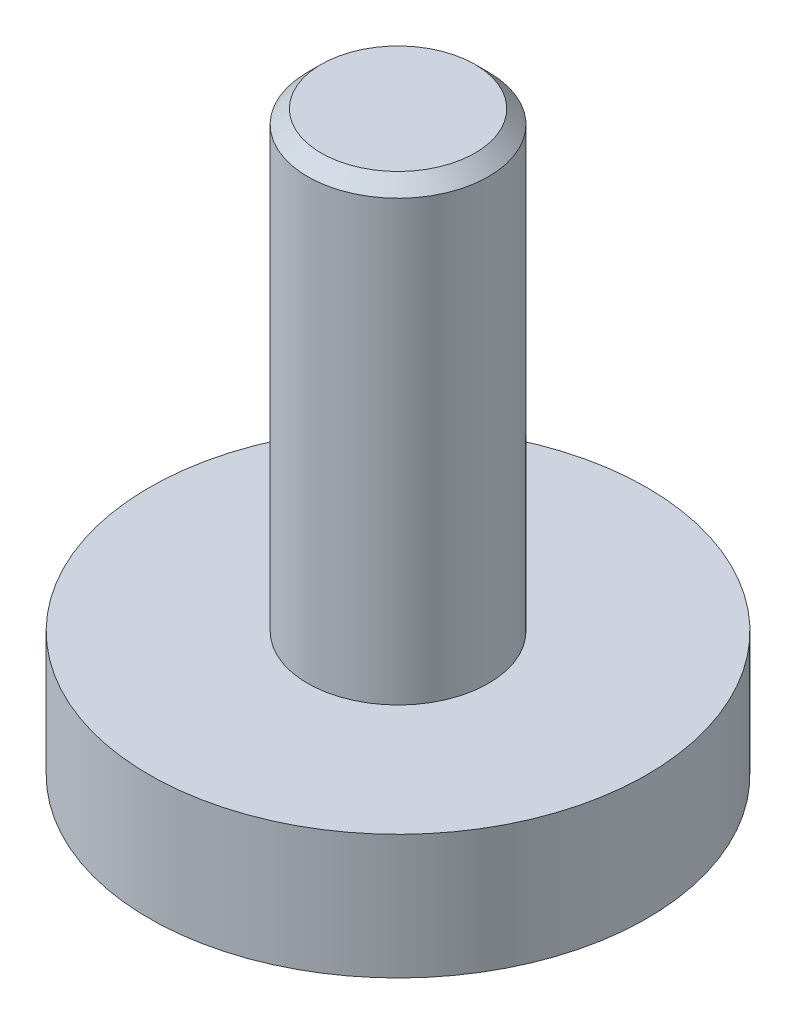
ISO-10303-21;
HEADER;
FILE_DESCRIPTION(('STEP AP214'),'2;1');
FILE_NAME('part.step','',(''),(''),'','','');
FILE_SCHEMA(('AUTOMOTIVE_DESIGN { 1 0 10303 214 1 1 1 1 }'));
ENDSEC;
DATA;
#1=APPLICATION_CONTEXT('core data for automotive mechanical design processes');
#2=APPLICATION_PROTOCOL_DEFINITION('international standard','automotive_design',2000,#1);
#3=PRODUCT_CONTEXT('',#1,'mechanical');
#4=PRODUCT('Part','Part','',(#3));
#5=PRODUCT_RELATED_PRODUCT_CATEGORY('part','',(#4));
#6=PRODUCT_DEFINITION_FORMATION('','',#4);
#7=PRODUCT_DEFINITION_CONTEXT('part definition',#1,'design');
#8=PRODUCT_DEFINITION('design','',#6,#7);
#9=PRODUCT_DEFINITION_SHAPE('','',#8);
#10=(LENGTH_UNIT() NAMED_UNIT(*) SI_UNIT(.MILLI.,.METRE.));
#11=(NAMED_UNIT(*) PLANE_ANGLE_UNIT() SI_UNIT($,.RADIAN.));
#12=(NAMED_UNIT(*) SI_UNIT($,.STERADIAN.) SOLID_ANGLE_UNIT());
#13=UNCERTAINTY_MEASURE_WITH_UNIT(LENGTH_MEASURE(1.E-05),#10,'distance_accuracy_value','');
#14=(GEOMETRIC_REPRESENTATION_CONTEXT(3) GLOBAL_UNCERTAINTY_ASSIGNED_CONTEXT((#13)) GLOBAL_UNIT_ASSIGNED_CONTEXT((#10,
#11,#12)) REPRESENTATION_CONTEXT('',''));
#15=CARTESIAN_POINT('',(0.,0.,0.));
#16=DIRECTION('',(0.,0.,1.));
#17=DIRECTION('',(1.,0.,0.));
#18=AXIS2_PLACEMENT_3D('',#15,#16,#17);
#19=CARTESIAN_POINT('',(0.,20.,0.));
#20=DIRECTION('',(0.,1.,0.));
#21=DIRECTION('',(0.,0.,1.));
#22=AXIS2_PLACEMENT_3D('',#19,#20,#21);
#23=PLANE('',#22);
#24=CARTESIAN_POINT('',(0.,20.,0.));
#25=DIRECTION('',(0.,-1.,0.));
#26=DIRECTION('',(0.,0.,-1.));
#27=AXIS2_PLACEMENT_3D('',#24,#25,#26);
#28=CIRCLE('',#27,3.3990931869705);
#29=CARTESIAN_POINT('',(0.,20.,-3.3990931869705));
#30=VERTEX_POINT('',#29);
#31=EDGE_CURVE('E11',#30,#30,#28,.T.);
#32=ORIENTED_EDGE('',*,*,#31,.F.);
#33=EDGE_LOOP('',(#32));
#34=FACE_BOUND('',#33,.T.);
#35=ADVANCED_FACE('F34',(#34),#23,.T.);
#36=CARTESIAN_POINT('',(0.,19.399093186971,0.));
#37=DIRECTION('',(0.,-1.,0.));
#38=DIRECTION('',(0.,0.,-1.));
#39=AXIS2_PLACEMENT_3D('',#36,#37,#38);
#40=CONICAL_SURFACE('',#39,4.,0.785398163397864);
#41=ORIENTED_EDGE('',*,*,#31,.T.);
#42=EDGE_LOOP('',(#41));
#43=FACE_BOUND('',#42,.T.);
#44=CARTESIAN_POINT('',(0.,19.399093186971,0.));
#45=DIRECTION('',(0.,-1.,0.));
#46=DIRECTION('',(0.,0.,-1.));
#47=AXIS2_PLACEMENT_3D('',#44,#45,#46);
#48=CIRCLE('',#47,4.);
#49=CARTESIAN_POINT('',(0.,19.399093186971,-4.));
#50=VERTEX_POINT('',#49);
#51=EDGE_CURVE('E41',#50,#50,#48,.T.);
#52=ORIENTED_EDGE('',*,*,#51,.F.);
#53=EDGE_LOOP('',(#52));
#54=FACE_BOUND('',#53,.T.);
#55=ADVANCED_FACE('F233',(#43,#54),#40,.T.);
#56=CARTESIAN_POINT('',(0.,-5.,0.));
#57=DIRECTION('',(0.,-1.,0.));
#58=DIRECTION('',(0.,0.,-1.));
#59=AXIS2_PLACEMENT_3D('',#56,#57,#58);
#60=CYLINDRICAL_SURFACE('',#59,4.);
#61=ORIENTED_EDGE('',*,*,#51,.T.);
#62=EDGE_LOOP('',(#61));
#63=FACE_BOUND('',#62,.T.);
#64=CARTESIAN_POINT('',(0.,0.,0.));
#65=DIRECTION('',(0.,-1.,0.));
#66=DIRECTION('',(0.,0.,-1.));
#67=AXIS2_PLACEMENT_3D('',#64,#65,#66);
#68=CIRCLE('',#67,4.);
#69=CARTESIAN_POINT('',(0.,0.,-4.));
#70=VERTEX_POINT('',#69);
#71=EDGE_CURVE('E245',#70,#70,#68,.T.);
#72=ORIENTED_EDGE('',*,*,#71,.F.);
#73=EDGE_LOOP('',(#72));
#74=FACE_BOUND('',#73,.T.);
#75=ADVANCED_FACE('F238',(#63,#74),#60,.T.);
#76=CARTESIAN_POINT('',(4.,0.,0.));
#77=DIRECTION('',(0.,1.,0.));
#78=DIRECTION('',(0.,0.,1.));
#79=AXIS2_PLACEMENT_3D('',#76,#77,#78);
#80=PLANE('',#79);
#81=ORIENTED_EDGE('',*,*,#71,.T.);
#82=EDGE_LOOP('',(#81));
#83=FACE_BOUND('',#82,.T.);
#84=CARTESIAN_POINT('',(0.,0.,0.));
#85=DIRECTION('',(0.,-1.,0.));
#86=DIRECTION('',(0.,0.,-1.));
#87=AXIS2_PLACEMENT_3D('',#84,#85,#86);
#88=CIRCLE('',#87,11.);
#89=CARTESIAN_POINT('',(0.,0.,-11.));
#90=VERTEX_POINT('',#89);
#91=EDGE_CURVE('E247',#90,#90,#88,.T.);
#92=ORIENTED_EDGE('',*,*,#91,.F.);
#93=EDGE_LOOP('',(#92));
#94=FACE_BOUND('',#93,.T.);
#95=ADVANCED_FACE('F392',(#83,#94),#80,.T.);
#96=CARTESIAN_POINT('',(0.,-5.,0.));
#97=DIRECTION('',(0.,-1.,0.));
#98=DIRECTION('',(0.,0.,-1.));
#99=AXIS2_PLACEMENT_3D('',#96,#97,#98);
#100=CYLINDRICAL_SURFACE('',#99,11.);
#101=ORIENTED_EDGE('',*,*,#91,.T.);
#102=EDGE_LOOP('',(#101));
#103=FACE_BOUND('',#102,.T.);
#104=CARTESIAN_POINT('',(0.,-5.5,0.));
#105=DIRECTION('',(0.,-1.,0.));
#106=DIRECTION('',(0.,0.,-1.));
#107=AXIS2_PLACEMENT_3D('',#104,#105,#106);
#108=CIRCLE('',#107,11.);
#109=CARTESIAN_POINT('',(0.,-5.5,-11.));
#110=VERTEX_POINT('',#109);
#111=EDGE_CURVE('E252',#110,#110,#108,.T.);
#112=ORIENTED_EDGE('',*,*,#111,.F.);
#113=EDGE_LOOP('',(#112));
#114=FACE_BOUND('',#113,.T.);
#115=ADVANCED_FACE('F384',(#103,#114),#100,.T.);
#116=CARTESIAN_POINT('',(11.,-5.5,0.));
#117=DIRECTION('',(0.,-1.,0.));
#118=DIRECTION('',(0.,0.,-1.));
#119=AXIS2_PLACEMENT_3D('',#116,#117,#118);
#120=PLANE('',#119);
#121=ORIENTED_EDGE('',*,*,#111,.T.);
#122=EDGE_LOOP('',(#121));
#123=FACE_BOUND('',#122,.T.);
#124=CARTESIAN_POINT('',(0.,-5.5,0.));
#125=DIRECTION('',(0.,-1.,0.));
#126=DIRECTION('',(0.,0.,-1.));
#127=AXIS2_PLACEMENT_3D('',#124,#125,#126);
#128=CIRCLE('',#127,9.5);
#129=CARTESIAN_POINT('',(0.,-5.5,-9.5));
#130=VERTEX_POINT('',#129);
#131=EDGE_CURVE('E255',#130,#130,#128,.T.);
#132=ORIENTED_EDGE('',*,*,#131,.F.);
#133=EDGE_LOOP('',(#132));
#134=FACE_BOUND('',#133,.T.);
#135=ADVANCED_FACE('F376',(#123,#134),#120,.T.);
#136=CARTESIAN_POINT('',(0.,-3.6,0.));
#137=DIRECTION('',(0.,-1.,0.));
#138=DIRECTION('',(0.,0.,-1.));
#139=AXIS2_PLACEMENT_3D('',#136,#137,#138);
#140=CONICAL_SURFACE('',#139,7.6,0.785398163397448);
#141=ORIENTED_EDGE('',*,*,#131,.T.);
#142=EDGE_LOOP('',(#141));
#143=FACE_BOUND('',#142,.T.);
#144=CARTESIAN_POINT('',(0.,-3.6,0.));
#145=DIRECTION('',(0.,-1.,0.));
#146=DIRECTION('',(0.,0.,-1.));
#147=AXIS2_PLACEMENT_3D('',#144,#145,#146);
#148=CIRCLE('',#147,7.6);
#149=CARTESIAN_POINT('',(0.,-3.6,-7.6));
#150=VERTEX_POINT('',#149);
#151=EDGE_CURVE('E258',#150,#150,#148,.T.);
#152=ORIENTED_EDGE('',*,*,#151,.F.);
#153=EDGE_LOOP('',(#152));
#154=FACE_BOUND('',#153,.T.);
#155=ADVANCED_FACE('F369',(#143,#154),#140,.F.);
#156=CARTESIAN_POINT('',(0.,-5.,0.));
#157=DIRECTION('',(0.,-1.,0.));
#158=DIRECTION('',(0.,0.,-1.));
#159=AXIS2_PLACEMENT_3D('',#156,#157,#158);
#160=CYLINDRICAL_SURFACE('',#159,7.6);
#161=ORIENTED_EDGE('',*,*,#151,.T.);
#162=EDGE_LOOP('',(#161));
#163=FACE_BOUND('',#162,.T.);
#164=CARTESIAN_POINT('',(0.,-5.,0.));
#165=DIRECTION('',(0.,-1.,0.));
#166=DIRECTION('',(0.,0.,-1.));
#167=AXIS2_PLACEMENT_3D('',#164,#165,#166);
#168=CIRCLE('',#167,7.6);
#169=CARTESIAN_POINT('',(0.,-5.,-7.6));
#170=VERTEX_POINT('',#169);
#171=EDGE_CURVE('E261',#170,#170,#168,.T.);
#172=ORIENTED_EDGE('',*,*,#171,.F.);
#173=EDGE_LOOP('',(#172));
#174=FACE_BOUND('',#173,.T.);
#175=ADVANCED_FACE('F362',(#163,#174),#160,.T.);
#176=CARTESIAN_POINT('',(7.6,-5.,0.));
#177=DIRECTION('',(0.,-1.,0.));
#178=DIRECTION('',(0.,0.,-1.));
#179=AXIS2_PLACEMENT_3D('',#176,#177,#178);
#180=PLANE('',#179);
#181=ORIENTED_EDGE('',*,*,#171,.T.);
#182=EDGE_LOOP('',(#181));
#183=FACE_BOUND('',#182,.T.);
#184=CARTESIAN_POINT('',(0.,-5.,0.));
#185=DIRECTION('',(0.,-1.,0.));
#186=DIRECTION('',(0.,0.,-1.));
#187=AXIS2_PLACEMENT_3D('',#184,#185,#186);
#188=CIRCLE('',#187,2.8875);
#189=CARTESIAN_POINT('',(0.,-5.,-2.8875));
#190=VERTEX_POINT('',#189);
#191=EDGE_CURVE('E264',#190,#190,#188,.T.);
#192=ORIENTED_EDGE('',*,*,#191,.F.);
#193=EDGE_LOOP('',(#192));
#194=FACE_BOUND('',#193,.T.);
#195=ADVANCED_FACE('F179',(#183,#194),#180,.T.);
#196=CARTESIAN_POINT('',(0.,-4.6125,0.));
#197=DIRECTION('',(0.,-1.,0.));
#198=DIRECTION('',(0.,0.,-1.));
#199=AXIS2_PLACEMENT_3D('',#196,#197,#198);
#200=CONICAL_SURFACE('',#199,2.5,0.785398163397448);
#201=CARTESIAN_POINT('',(2.5,-6.02724218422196,-3.01250831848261));
#202=CARTESIAN_POINT('',(2.5,-5.97124871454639,-2.93972869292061));
#203=CARTESIAN_POINT('',(2.5,-5.91575690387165,-2.86655695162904));
#204=CARTESIAN_POINT('',(2.5,-5.80600579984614,-2.71926895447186));
#205=CARTESIAN_POINT('',(2.5,-5.75174680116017,-2.64515247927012));
#206=CARTESIAN_POINT('',(2.5,-5.64430439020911,-2.49527311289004));
#207=CARTESIAN_POINT('',(2.5,-5.59113250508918,-2.41950193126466));
#208=CARTESIAN_POINT('',(2.5,-5.48663884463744,-2.26669857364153));
#209=CARTESIAN_POINT('',(2.5,-5.435316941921,-2.18966648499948));
#210=CARTESIAN_POINT('',(2.5,-5.33175371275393,-2.02918442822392));
#211=CARTESIAN_POINT('',(2.5,-5.27966140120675,-1.94563781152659));
#212=CARTESIAN_POINT('',(2.5,-5.17872532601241,-1.77660749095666));
#213=CARTESIAN_POINT('',(2.5,-5.12988113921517,-1.69112404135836));
#214=CARTESIAN_POINT('',(2.5,-5.03645729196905,-1.51815974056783));
#215=CARTESIAN_POINT('',(2.5,-4.99186570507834,-1.43068538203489));
#216=CARTESIAN_POINT('',(2.5,-4.90795433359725,-1.25326366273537));
#217=CARTESIAN_POINT('',(2.5,-4.86863206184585,-1.16331749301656));
#218=CARTESIAN_POINT('',(2.5,-4.80023635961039,-0.98976705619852));
#219=CARTESIAN_POINT('',(2.5,-4.7705344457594,-0.90641301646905));
#220=CARTESIAN_POINT('',(2.5,-4.71780257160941,-0.73758107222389));
#221=CARTESIAN_POINT('',(2.5,-4.6947730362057,-0.652103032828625));
#222=CARTESIAN_POINT('',(2.5,-4.6570164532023,-0.481022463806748));
#223=CARTESIAN_POINT('',(2.5,-4.64213859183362,-0.395453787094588));
#224=CARTESIAN_POINT('',(2.5,-4.62099579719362,-0.223253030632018));
#225=CARTESIAN_POINT('',(2.5,-4.61472907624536,-0.136621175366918));
#226=CARTESIAN_POINT('',(2.5,-4.61134246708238,0.0330320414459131));
#227=CARTESIAN_POINT('',(2.5,-4.61383479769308,0.116045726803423));
#228=CARTESIAN_POINT('',(2.5,-4.62693860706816,0.281424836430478));
#229=CARTESIAN_POINT('',(2.5,-4.637550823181,0.363790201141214));
#230=CARTESIAN_POINT('',(2.5,-4.66647391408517,0.528675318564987));
#231=CARTESIAN_POINT('',(2.5,-4.68492072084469,0.61117085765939));
#232=CARTESIAN_POINT('',(2.5,-4.72849243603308,0.77433666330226));
#233=CARTESIAN_POINT('',(2.5,-4.7536169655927,0.855007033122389));
#234=CARTESIAN_POINT('',(2.5,-4.84053448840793,1.10325551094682));
#235=CARTESIAN_POINT('',(2.5,-4.91198150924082,1.26746418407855));
#236=CARTESIAN_POINT('',(2.5,-5.03116558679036,1.50779381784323));
#237=CARTESIAN_POINT('',(2.5,-5.07298833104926,1.58705371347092));
#238=CARTESIAN_POINT('',(2.5,-5.15987736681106,1.74377955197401));
#239=CARTESIAN_POINT('',(2.5,-5.20494308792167,1.82124580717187));
#240=CARTESIAN_POINT('',(2.5,-5.29537825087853,1.97080736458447));
#241=CARTESIAN_POINT('',(2.5,-5.34062285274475,2.042979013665));
#242=CARTESIAN_POINT('',(2.5,-5.43303910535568,2.18608393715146));
#243=CARTESIAN_POINT('',(2.5,-5.48021090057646,2.25701711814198));
#244=CARTESIAN_POINT('',(2.5,-5.57575265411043,2.39723504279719));
#245=CARTESIAN_POINT('',(2.5,-5.62410995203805,2.46652844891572));
#246=CARTESIAN_POINT('',(2.5,-5.7221208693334,2.60416464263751));
#247=CARTESIAN_POINT('',(2.5,-5.77177412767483,2.67250768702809));
#248=CARTESIAN_POINT('',(2.5,-5.82195799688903,2.74045226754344));
#249=B_SPLINE_CURVE_WITH_KNOTS('',3,(#201,#202,#203,#204,#205,#206,#207,#208,#209,#210,#211,
#212,#213,#214,#215,#216,#217,#218,#219,#220,#221,#222,#223,#224,#225,#226,#227,#228,#229,#230,
#231,#232,#233,#234,#235,#236,#237,#238,#239,#240,#241,#242,#243,#244,#245,#246,#247,#248),
.UNSPECIFIED.,.F.,.F.,(4,2,2,2,2,2,2,2,2,2,2,2,2,2,2,2,2,2,2,2,2,2,2,4),(0.,0.275485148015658,
0.551035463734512,0.828711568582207,1.10636851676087,1.40167925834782,1.69695145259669,
1.99136957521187,2.28564823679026,2.55088300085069,2.81613465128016,3.07629720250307,
3.3364057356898,3.58514655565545,3.83390996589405,4.08717813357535,4.34043193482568,
4.8760096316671,5.14483885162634,5.4136209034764,5.66913305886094,5.92466440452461,
6.17814416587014,6.43155405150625),.UNSPECIFIED.);
#250=CARTESIAN_POINT('',(2.5,-4.99925134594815,-1.4433756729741));
#251=VERTEX_POINT('',#250);
#252=CARTESIAN_POINT('',(2.5,-4.99925134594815,1.4433756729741));
#253=VERTEX_POINT('',#252);
#254=EDGE_CURVE('E195',#251,#253,#249,.T.);
#255=ORIENTED_EDGE('',*,*,#254,.F.);
#256=CARTESIAN_POINT('',(-0.0002,-4.99936682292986,-2.88686681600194));
#257=CARTESIAN_POINT('',(0.0857382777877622,-4.94979205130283,-2.83725032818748));
#258=CARTESIAN_POINT('',(0.173113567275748,-4.90312882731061,-2.78680418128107));
#259=CARTESIAN_POINT('',(0.351281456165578,-4.81768948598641,-2.68393890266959));
#260=CARTESIAN_POINT('',(0.442091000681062,-4.77896090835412,-2.63150998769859));
#261=CARTESIAN_POINT('',(0.625204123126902,-4.71261804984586,-2.52578957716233));
#262=CARTESIAN_POINT('',(0.717461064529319,-4.68483701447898,-2.47252500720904));
#263=CARTESIAN_POINT('',(0.904006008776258,-4.6420345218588,-2.36482323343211));
#264=CARTESIAN_POINT('',(0.998288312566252,-4.62698111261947,-2.31038931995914));
#265=CARTESIAN_POINT('',(1.16077825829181,-4.61339906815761,-2.21657570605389));
#266=CARTESIAN_POINT('',(1.22877596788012,-4.61138844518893,-2.1773172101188));
#267=CARTESIAN_POINT('',(1.36466024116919,-4.61477546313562,-2.09886438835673));
#268=CARTESIAN_POINT('',(1.4325467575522,-4.62017570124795,-2.05967008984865));
#269=CARTESIAN_POINT('',(1.56767878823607,-4.6380771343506,-1.98165157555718));
#270=CARTESIAN_POINT('',(1.63492349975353,-4.65058627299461,-1.942827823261));
#271=CARTESIAN_POINT('',(1.76825010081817,-4.68201884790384,-1.86585167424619));
#272=CARTESIAN_POINT('',(1.83433207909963,-4.70094179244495,-1.82769922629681));
#273=CARTESIAN_POINT('',(2.00359634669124,-4.75711870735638,-1.72997445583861));
#274=CARTESIAN_POINT('',(2.10572912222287,-4.79860717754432,-1.67100807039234));
#275=CARTESIAN_POINT('',(2.2559064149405,-4.86864539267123,-1.58430317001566));
#276=CARTESIAN_POINT('',(2.3053965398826,-4.89325359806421,-1.55573003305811));
#277=CARTESIAN_POINT('',(2.40346006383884,-4.94471323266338,-1.49911303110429));
#278=CARTESIAN_POINT('',(2.45203400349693,-4.9715632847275,-1.4710688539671));
#279=CARTESIAN_POINT('',(2.5002,-4.99936682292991,-1.44326020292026));
#280=B_SPLINE_CURVE_WITH_KNOTS('',3,(#256,#257,#258,#259,#260,#261,#262,#263,#264,#265,#266,
#267,#268,#269,#270,#271,#272,#273,#274,#275,#276,#277,#278,#279),.UNSPECIFIED.,.F.,.F.,(4,2,2,
2,2,2,2,2,2,2,2,4),(0.,0.333012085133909,0.667964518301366,0.997597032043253,1.32639954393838,
1.56169424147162,1.79707142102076,2.03271213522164,2.26833478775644,2.64260240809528,
2.82922877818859,3.01574133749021),.UNSPECIFIED.);
#281=CARTESIAN_POINT('',(0.,-4.9992513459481,-2.8867513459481));
#282=VERTEX_POINT('',#281);
#283=EDGE_CURVE('E189',#282,#251,#280,.T.);
#284=ORIENTED_EDGE('',*,*,#283,.F.);
#285=CARTESIAN_POINT('',(-2.5002,-4.99936682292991,-1.44326020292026));
#286=CARTESIAN_POINT('',(-2.41426172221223,-4.94979205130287,-1.49287669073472));
#287=CARTESIAN_POINT('',(-2.32688643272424,-4.90312882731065,-1.54332283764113));
#288=CARTESIAN_POINT('',(-2.1487185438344,-4.81768948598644,-1.64618811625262));
#289=CARTESIAN_POINT('',(-2.05790899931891,-4.77896090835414,-1.69861703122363));
#290=CARTESIAN_POINT('',(-1.87479587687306,-4.71261804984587,-1.80433744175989));
#291=CARTESIAN_POINT('',(-1.78253893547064,-4.68483701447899,-1.85760201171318));
#292=CARTESIAN_POINT('',(-1.59599399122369,-4.6420345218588,-1.96530378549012));
#293=CARTESIAN_POINT('',(-1.50171168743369,-4.62698111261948,-2.01973769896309));
#294=CARTESIAN_POINT('',(-1.33922174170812,-4.61339906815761,-2.11355131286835));
#295=CARTESIAN_POINT('',(-1.27122403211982,-4.61138844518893,-2.15280980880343));
#296=CARTESIAN_POINT('',(-1.13533975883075,-4.61477546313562,-2.23126263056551));
#297=CARTESIAN_POINT('',(-1.06745324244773,-4.62017570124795,-2.27045692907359));
#298=CARTESIAN_POINT('',(-0.932321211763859,-4.6380771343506,-2.34847544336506));
#299=CARTESIAN_POINT('',(-0.865076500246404,-4.65058627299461,-2.38729919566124));
#300=CARTESIAN_POINT('',(-0.731749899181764,-4.68201884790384,-2.46427534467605));
#301=CARTESIAN_POINT('',(-0.665667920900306,-4.70094179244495,-2.50242779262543));
#302=CARTESIAN_POINT('',(-0.496403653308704,-4.75711870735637,-2.60015256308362));
#303=CARTESIAN_POINT('',(-0.394270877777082,-4.79860717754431,-2.65911894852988));
#304=CARTESIAN_POINT('',(-0.244093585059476,-4.8686453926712,-2.74582384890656));
#305=CARTESIAN_POINT('',(-0.194603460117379,-4.89325359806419,-2.7743969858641));
#306=CARTESIAN_POINT('',(-0.0965399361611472,-4.94471323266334,-2.83101398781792));
#307=CARTESIAN_POINT('',(-0.047965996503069,-4.97156328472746,-2.85905816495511));
#308=CARTESIAN_POINT('',(0.000200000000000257,-4.99936682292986,-2.88686681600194));
#309=B_SPLINE_CURVE_WITH_KNOTS('',3,(#285,#286,#287,#288,#289,#290,#291,#292,#293,#294,#295,
#296,#297,#298,#299,#300,#301,#302,#303,#304,#305,#306,#307,#308),.UNSPECIFIED.,.F.,.F.,(4,2,2,
2,2,2,2,2,2,2,2,4),(0.,0.33301208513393,0.66796451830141,0.997597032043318,1.32639954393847,
1.56169424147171,1.79707142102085,2.03271213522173,2.26833478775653,2.64260240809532,
2.82922877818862,3.01574133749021),.UNSPECIFIED.);
#310=CARTESIAN_POINT('',(-2.5,-4.99925134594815,-1.4433756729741));
#311=VERTEX_POINT('',#310);
#312=EDGE_CURVE('E166',#311,#282,#309,.T.);
#313=ORIENTED_EDGE('',*,*,#312,.F.);
#314=CARTESIAN_POINT('',(-2.5,-6.02724218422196,-3.01250831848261));
#315=CARTESIAN_POINT('',(-2.5,-5.97124871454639,-2.93972869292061));
#316=CARTESIAN_POINT('',(-2.5,-5.91575690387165,-2.86655695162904));
#317=CARTESIAN_POINT('',(-2.5,-5.80600579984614,-2.71926895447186));
#318=CARTESIAN_POINT('',(-2.5,-5.75174680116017,-2.64515247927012));
#319=CARTESIAN_POINT('',(-2.5,-5.64430439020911,-2.49527311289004));
#320=CARTESIAN_POINT('',(-2.5,-5.59113250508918,-2.41950193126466));
#321=CARTESIAN_POINT('',(-2.5,-5.48663884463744,-2.26669857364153));
#322=CARTESIAN_POINT('',(-2.5,-5.435316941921,-2.18966648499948));
#323=CARTESIAN_POINT('',(-2.5,-5.33175371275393,-2.02918442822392));
#324=CARTESIAN_POINT('',(-2.5,-5.27966140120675,-1.94563781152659));
#325=CARTESIAN_POINT('',(-2.5,-5.17872532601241,-1.77660749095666));
#326=CARTESIAN_POINT('',(-2.5,-5.12988113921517,-1.69112404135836));
#327=CARTESIAN_POINT('',(-2.5,-5.03645729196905,-1.51815974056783));
#328=CARTESIAN_POINT('',(-2.5,-4.99186570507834,-1.43068538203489));
#329=CARTESIAN_POINT('',(-2.5,-4.90795433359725,-1.25326366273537));
#330=CARTESIAN_POINT('',(-2.5,-4.86863206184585,-1.16331749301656));
#331=CARTESIAN_POINT('',(-2.5,-4.80023635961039,-0.98976705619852));
#332=CARTESIAN_POINT('',(-2.5,-4.7705344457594,-0.90641301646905));
#333=CARTESIAN_POINT('',(-2.5,-4.71780257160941,-0.73758107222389));
#334=CARTESIAN_POINT('',(-2.5,-4.6947730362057,-0.652103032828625));
#335=CARTESIAN_POINT('',(-2.5,-4.6570164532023,-0.481022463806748));
#336=CARTESIAN_POINT('',(-2.5,-4.64213859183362,-0.395453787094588));
#337=CARTESIAN_POINT('',(-2.5,-4.62099579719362,-0.223253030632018));
#338=CARTESIAN_POINT('',(-2.5,-4.61472907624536,-0.136621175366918));
#339=CARTESIAN_POINT('',(-2.5,-4.61134246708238,0.0330320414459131));
#340=CARTESIAN_POINT('',(-2.5,-4.61383479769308,0.116045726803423));
#341=CARTESIAN_POINT('',(-2.5,-4.62693860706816,0.281424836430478));
#342=CARTESIAN_POINT('',(-2.5,-4.637550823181,0.363790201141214));
#343=CARTESIAN_POINT('',(-2.5,-4.66647391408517,0.528675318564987));
#344=CARTESIAN_POINT('',(-2.5,-4.68492072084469,0.61117085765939));
#345=CARTESIAN_POINT('',(-2.5,-4.72849243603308,0.77433666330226));
#346=CARTESIAN_POINT('',(-2.5,-4.7536169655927,0.855007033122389));
#347=CARTESIAN_POINT('',(-2.5,-4.84053448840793,1.10325551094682));
#348=CARTESIAN_POINT('',(-2.5,-4.91198150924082,1.26746418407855));
#349=CARTESIAN_POINT('',(-2.5,-5.03116558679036,1.50779381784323));
#350=CARTESIAN_POINT('',(-2.5,-5.07298833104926,1.58705371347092));
#351=CARTESIAN_POINT('',(-2.5,-5.15987736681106,1.74377955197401));
#352=CARTESIAN_POINT('',(-2.5,-5.20494308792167,1.82124580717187));
#353=CARTESIAN_POINT('',(-2.5,-5.29537825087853,1.97080736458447));
#354=CARTESIAN_POINT('',(-2.5,-5.34062285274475,2.042979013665));
#355=CARTESIAN_POINT('',(-2.5,-5.43303910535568,2.18608393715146));
#356=CARTESIAN_POINT('',(-2.5,-5.48021090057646,2.25701711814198));
#357=CARTESIAN_POINT('',(-2.5,-5.57575265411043,2.39723504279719));
#358=CARTESIAN_POINT('',(-2.5,-5.62410995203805,2.46652844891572));
#359=CARTESIAN_POINT('',(-2.5,-5.7221208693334,2.60416464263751));
#360=CARTESIAN_POINT('',(-2.5,-5.77177412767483,2.67250768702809));
#361=CARTESIAN_POINT('',(-2.5,-5.82195799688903,2.74045226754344));
#362=B_SPLINE_CURVE_WITH_KNOTS('',3,(#314,#315,#316,#317,#318,#319,#320,#321,#322,#323,#324,
#325,#326,#327,#328,#329,#330,#331,#332,#333,#334,#335,#336,#337,#338,#339,#340,#341,#342,#343,
#344,#345,#346,#347,#348,#349,#350,#351,#352,#353,#354,#355,#356,#357,#358,#359,#360,#361),
.UNSPECIFIED.,.F.,.F.,(4,2,2,2,2,2,2,2,2,2,2,2,2,2,2,2,2,2,2,2,2,2,2,4),(0.,0.275485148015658,
0.551035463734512,0.828711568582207,1.10636851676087,1.40167925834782,1.69695145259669,
1.99136957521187,2.28564823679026,2.55088300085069,2.81613465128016,3.07629720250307,
3.3364057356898,3.58514655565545,3.83390996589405,4.08717813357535,4.34043193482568,
4.8760096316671,5.14483885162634,5.4136209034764,5.66913305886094,5.92466440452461,
6.17814416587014,6.43155405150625),.UNSPECIFIED.);
#363=CARTESIAN_POINT('',(-2.5,-4.99925134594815,1.4433756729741));
#364=VERTEX_POINT('',#363);
#365=EDGE_CURVE('E148',#364,#311,#362,.F.);
#366=ORIENTED_EDGE('',*,*,#365,.F.);
#367=CARTESIAN_POINT('',(0.0002,-4.99936682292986,2.88686681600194));
#368=CARTESIAN_POINT('',(-0.0857382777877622,-4.94979205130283,2.83725032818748));
#369=CARTESIAN_POINT('',(-0.173113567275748,-4.90312882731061,2.78680418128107));
#370=CARTESIAN_POINT('',(-0.351281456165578,-4.81768948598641,2.68393890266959));
#371=CARTESIAN_POINT('',(-0.442091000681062,-4.77896090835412,2.63150998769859));
#372=CARTESIAN_POINT('',(-0.625204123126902,-4.71261804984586,2.52578957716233));
#373=CARTESIAN_POINT('',(-0.717461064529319,-4.68483701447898,2.47252500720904));
#374=CARTESIAN_POINT('',(-0.904006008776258,-4.6420345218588,2.36482323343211));
#375=CARTESIAN_POINT('',(-0.998288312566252,-4.62698111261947,2.31038931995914));
#376=CARTESIAN_POINT('',(-1.16077825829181,-4.61339906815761,2.21657570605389));
#377=CARTESIAN_POINT('',(-1.22877596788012,-4.61138844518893,2.1773172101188));
#378=CARTESIAN_POINT('',(-1.36466024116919,-4.61477546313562,2.09886438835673));
#379=CARTESIAN_POINT('',(-1.4325467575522,-4.62017570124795,2.05967008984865));
#380=CARTESIAN_POINT('',(-1.56767878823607,-4.6380771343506,1.98165157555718));
#381=CARTESIAN_POINT('',(-1.63492349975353,-4.65058627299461,1.942827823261));
#382=CARTESIAN_POINT('',(-1.76825010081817,-4.68201884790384,1.86585167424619));
#383=CARTESIAN_POINT('',(-1.83433207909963,-4.70094179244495,1.82769922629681));
#384=CARTESIAN_POINT('',(-2.00359634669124,-4.75711870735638,1.72997445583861));
#385=CARTESIAN_POINT('',(-2.10572912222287,-4.79860717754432,1.67100807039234));
#386=CARTESIAN_POINT('',(-2.2559064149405,-4.86864539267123,1.58430317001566));
#387=CARTESIAN_POINT('',(-2.3053965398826,-4.89325359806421,1.55573003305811));
#388=CARTESIAN_POINT('',(-2.40346006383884,-4.94471323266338,1.49911303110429));
#389=CARTESIAN_POINT('',(-2.45203400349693,-4.9715632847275,1.4710688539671));
#390=CARTESIAN_POINT('',(-2.5002,-4.99936682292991,1.44326020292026));
#391=B_SPLINE_CURVE_WITH_KNOTS('',3,(#367,#368,#369,#370,#371,#372,#373,#374,#375,#376,#377,
#378,#379,#380,#381,#382,#383,#384,#385,#386,#387,#388,#389,#390),.UNSPECIFIED.,.F.,.F.,(4,2,2,
2,2,2,2,2,2,2,2,4),(0.,0.333012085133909,0.667964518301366,0.997597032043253,1.32639954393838,
1.56169424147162,1.79707142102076,2.03271213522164,2.26833478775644,2.64260240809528,
2.82922877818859,3.01574133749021),.UNSPECIFIED.);
#392=CARTESIAN_POINT('',(0.,-4.9992513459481,2.8867513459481));
#393=VERTEX_POINT('',#392);
#394=EDGE_CURVE('E121',#393,#364,#391,.T.);
#395=ORIENTED_EDGE('',*,*,#394,.F.);
#396=CARTESIAN_POINT('',(2.5002,-4.99936682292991,1.44326020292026));
#397=CARTESIAN_POINT('',(2.41426172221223,-4.94979205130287,1.49287669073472));
#398=CARTESIAN_POINT('',(2.32688643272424,-4.90312882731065,1.54332283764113));
#399=CARTESIAN_POINT('',(2.1487185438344,-4.81768948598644,1.64618811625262));
#400=CARTESIAN_POINT('',(2.05790899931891,-4.77896090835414,1.69861703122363));
#401=CARTESIAN_POINT('',(1.87479587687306,-4.71261804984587,1.80433744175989));
#402=CARTESIAN_POINT('',(1.78253893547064,-4.68483701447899,1.85760201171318));
#403=CARTESIAN_POINT('',(1.59599399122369,-4.6420345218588,1.96530378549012));
#404=CARTESIAN_POINT('',(1.50171168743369,-4.62698111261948,2.01973769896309));
#405=CARTESIAN_POINT('',(1.33922174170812,-4.61339906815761,2.11355131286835));
#406=CARTESIAN_POINT('',(1.27122403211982,-4.61138844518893,2.15280980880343));
#407=CARTESIAN_POINT('',(1.13533975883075,-4.61477546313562,2.23126263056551));
#408=CARTESIAN_POINT('',(1.06745324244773,-4.62017570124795,2.27045692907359));
#409=CARTESIAN_POINT('',(0.932321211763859,-4.6380771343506,2.34847544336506));
#410=CARTESIAN_POINT('',(0.865076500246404,-4.65058627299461,2.38729919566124));
#411=CARTESIAN_POINT('',(0.731749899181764,-4.68201884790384,2.46427534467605));
#412=CARTESIAN_POINT('',(0.665667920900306,-4.70094179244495,2.50242779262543));
#413=CARTESIAN_POINT('',(0.496403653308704,-4.75711870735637,2.60015256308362));
#414=CARTESIAN_POINT('',(0.394270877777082,-4.79860717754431,2.65911894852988));
#415=CARTESIAN_POINT('',(0.244093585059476,-4.8686453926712,2.74582384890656));
#416=CARTESIAN_POINT('',(0.194603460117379,-4.89325359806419,2.7743969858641));
#417=CARTESIAN_POINT('',(0.0965399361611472,-4.94471323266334,2.83101398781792));
#418=CARTESIAN_POINT('',(0.047965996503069,-4.97156328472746,2.85905816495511));
#419=CARTESIAN_POINT('',(-0.000200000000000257,-4.99936682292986,2.88686681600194));
#420=B_SPLINE_CURVE_WITH_KNOTS('',3,(#396,#397,#398,#399,#400,#401,#402,#403,#404,#405,#406,
#407,#408,#409,#410,#411,#412,#413,#414,#415,#416,#417,#418,#419),.UNSPECIFIED.,.F.,.F.,(4,2,2,
2,2,2,2,2,2,2,2,4),(0.,0.33301208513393,0.66796451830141,0.997597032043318,1.32639954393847,
1.56169424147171,1.79707142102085,2.03271213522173,2.26833478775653,2.64260240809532,
2.82922877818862,3.01574133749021),.UNSPECIFIED.);
#421=EDGE_CURVE('E201',#253,#393,#420,.T.);
#422=ORIENTED_EDGE('',*,*,#421,.F.);
#423=EDGE_LOOP('',(#255,#284,#313,#366,#395,#422));
#424=FACE_BOUND('',#423,.T.);
#425=ORIENTED_EDGE('',*,*,#191,.T.);
#426=EDGE_LOOP('',(#425));
#427=FACE_BOUND('',#426,.T.);
#428=ADVANCED_FACE('F174',(#424,#427),#200,.F.);
#429=CARTESIAN_POINT('',(0.,-1.5,2.8867513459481));
#430=DIRECTION('',(-0.499999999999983,0.,0.866025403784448));
#431=DIRECTION('',(0.866025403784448,0.,0.499999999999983));
#432=AXIS2_PLACEMENT_3D('',#429,#430,#431);
#433=PLANE('',#432);
#434=ORIENTED_EDGE('',*,*,#394,.T.);
#435=DIRECTION('',(0.,-1.,0.));
#436=VECTOR('',#435,1.);
#437=CARTESIAN_POINT('',(-2.5,-1.5,1.4433756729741));
#438=LINE('',#437,#436);
#439=CARTESIAN_POINT('',(-2.5,-1.5,1.4433756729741));
#440=VERTEX_POINT('',#439);
#441=EDGE_CURVE('E117',#440,#364,#438,.T.);
#442=ORIENTED_EDGE('',*,*,#441,.F.);
#443=DIRECTION('',(-0.866025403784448,0.,-0.499999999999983));
#444=VECTOR('',#443,1.);
#445=CARTESIAN_POINT('',(0.,-1.5,2.8867513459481));
#446=LINE('',#445,#444);
#447=CARTESIAN_POINT('',(-1.24999999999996,-1.5,2.16506350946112));
#448=VERTEX_POINT('',#447);
#449=EDGE_CURVE('E104',#448,#440,#446,.T.);
#450=ORIENTED_EDGE('',*,*,#449,.F.);
#451=CARTESIAN_POINT('',(0.,-1.5,2.8867513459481));
#452=VERTEX_POINT('',#451);
#453=EDGE_CURVE('E114',#452,#448,#446,.T.);
#454=ORIENTED_EDGE('',*,*,#453,.F.);
#455=DIRECTION('',(0.,-1.,0.));
#456=VECTOR('',#455,1.);
#457=CARTESIAN_POINT('',(0.,-1.5,2.8867513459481));
#458=LINE('',#457,#456);
#459=EDGE_CURVE('E146',#452,#393,#458,.T.);
#460=ORIENTED_EDGE('',*,*,#459,.T.);
#461=EDGE_LOOP('',(#434,#442,#450,#454,#460));
#462=FACE_BOUND('',#461,.T.);
#463=ADVANCED_FACE('F118',(#462),#433,.F.);
#464=CARTESIAN_POINT('',(2.5,-1.5,1.4433756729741));
#465=DIRECTION('',(0.499999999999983,0.,0.866025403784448));
#466=DIRECTION('',(0.866025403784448,0.,-0.499999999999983));
#467=AXIS2_PLACEMENT_3D('',#464,#465,#466);
#468=PLANE('',#467);
#469=ORIENTED_EDGE('',*,*,#421,.T.);
#470=ORIENTED_EDGE('',*,*,#459,.F.);
#471=DIRECTION('',(-0.866025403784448,0.,0.499999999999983));
#472=VECTOR('',#471,1.);
#473=CARTESIAN_POINT('',(2.5,-1.5,1.4433756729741));
#474=LINE('',#473,#472);
#475=CARTESIAN_POINT('',(1.24999999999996,-1.5,2.16506350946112));
#476=VERTEX_POINT('',#475);
#477=EDGE_CURVE('E143',#476,#452,#474,.T.);
#478=ORIENTED_EDGE('',*,*,#477,.F.);
#479=CARTESIAN_POINT('',(2.5,-1.5,1.4433756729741));
#480=VERTEX_POINT('',#479);
#481=EDGE_CURVE('E125',#480,#476,#474,.T.);
#482=ORIENTED_EDGE('',*,*,#481,.F.);
#483=DIRECTION('',(0.,-1.,0.));
#484=VECTOR('',#483,1.);
#485=CARTESIAN_POINT('',(2.5,-1.5,1.4433756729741));
#486=LINE('',#485,#484);
#487=EDGE_CURVE('E149',#480,#253,#486,.T.);
#488=ORIENTED_EDGE('',*,*,#487,.T.);
#489=EDGE_LOOP('',(#469,#470,#478,#482,#488));
#490=FACE_BOUND('',#489,.T.);
#491=ADVANCED_FACE('F210',(#490),#468,.F.);
#492=CARTESIAN_POINT('',(2.5,-1.5,-1.4433756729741));
#493=DIRECTION('',(1.,0.,0.));
#494=DIRECTION('',(0.,0.,-1.));
#495=AXIS2_PLACEMENT_3D('',#492,#493,#494);
#496=PLANE('',#495);
#497=ORIENTED_EDGE('',*,*,#254,.T.);
#498=ORIENTED_EDGE('',*,*,#487,.F.);
#499=DIRECTION('',(0.,0.,1.));
#500=VECTOR('',#499,1.);
#501=CARTESIAN_POINT('',(2.5,-1.5,-1.4433756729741));
#502=LINE('',#501,#500);
#503=CARTESIAN_POINT('',(2.5,-1.5,0.));
#504=VERTEX_POINT('',#503);
#505=EDGE_CURVE('E139',#504,#480,#502,.T.);
#506=ORIENTED_EDGE('',*,*,#505,.F.);
#507=CARTESIAN_POINT('',(2.5,-1.5,-1.4433756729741));
#508=VERTEX_POINT('',#507);
#509=EDGE_CURVE('E140',#508,#504,#502,.T.);
#510=ORIENTED_EDGE('',*,*,#509,.F.);
#511=DIRECTION('',(0.,-1.,0.));
#512=VECTOR('',#511,1.);
#513=CARTESIAN_POINT('',(2.5,-1.5,-1.4433756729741));
#514=LINE('',#513,#512);
#515=EDGE_CURVE('E152',#508,#251,#514,.T.);
#516=ORIENTED_EDGE('',*,*,#515,.T.);
#517=EDGE_LOOP('',(#497,#498,#506,#510,#516));
#518=FACE_BOUND('',#517,.T.);
#519=ADVANCED_FACE('F214',(#518),#496,.F.);
#520=CARTESIAN_POINT('',(0.,-1.5,-2.8867513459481));
#521=DIRECTION('',(0.499999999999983,0.,-0.866025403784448));
#522=DIRECTION('',(-0.866025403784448,0.,-0.499999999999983));
#523=AXIS2_PLACEMENT_3D('',#520,#521,#522);
#524=PLANE('',#523);
#525=ORIENTED_EDGE('',*,*,#283,.T.);
#526=ORIENTED_EDGE('',*,*,#515,.F.);
#527=DIRECTION('',(0.866025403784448,0.,0.499999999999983));
#528=VECTOR('',#527,1.);
#529=CARTESIAN_POINT('',(0.,-1.5,-2.8867513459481));
#530=LINE('',#529,#528);
#531=CARTESIAN_POINT('',(1.24999999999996,-1.5,-2.16506350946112));
#532=VERTEX_POINT('',#531);
#533=EDGE_CURVE('E137',#532,#508,#530,.T.);
#534=ORIENTED_EDGE('',*,*,#533,.F.);
#535=CARTESIAN_POINT('',(0.,-1.5,-2.8867513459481));
#536=VERTEX_POINT('',#535);
#537=EDGE_CURVE('E48',#536,#532,#530,.T.);
#538=ORIENTED_EDGE('',*,*,#537,.F.);
#539=DIRECTION('',(0.,-1.,0.));
#540=VECTOR('',#539,1.);
#541=CARTESIAN_POINT('',(0.,-1.5,-2.8867513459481));
#542=LINE('',#541,#540);
#543=EDGE_CURVE('E155',#536,#282,#542,.T.);
#544=ORIENTED_EDGE('',*,*,#543,.T.);
#545=EDGE_LOOP('',(#525,#526,#534,#538,#544));
#546=FACE_BOUND('',#545,.T.);
#547=ADVANCED_FACE('F219',(#546),#524,.F.);
#548=CARTESIAN_POINT('',(-2.5,-1.5,-1.4433756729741));
#549=DIRECTION('',(-0.499999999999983,0.,-0.866025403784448));
#550=DIRECTION('',(-0.866025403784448,0.,0.499999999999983));
#551=AXIS2_PLACEMENT_3D('',#548,#549,#550);
#552=PLANE('',#551);
#553=ORIENTED_EDGE('',*,*,#312,.T.);
#554=ORIENTED_EDGE('',*,*,#543,.F.);
#555=DIRECTION('',(0.866025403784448,0.,-0.499999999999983));
#556=VECTOR('',#555,1.);
#557=CARTESIAN_POINT('',(-2.5,-1.5,-1.4433756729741));
#558=LINE('',#557,#556);
#559=CARTESIAN_POINT('',(-1.24999999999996,-1.5,-2.16506350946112));
#560=VERTEX_POINT('',#559);
#561=EDGE_CURVE('E131',#560,#536,#558,.T.);
#562=ORIENTED_EDGE('',*,*,#561,.F.);
#563=CARTESIAN_POINT('',(-2.5,-1.5,-1.4433756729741));
#564=VERTEX_POINT('',#563);
#565=EDGE_CURVE('E133',#564,#560,#558,.T.);
#566=ORIENTED_EDGE('',*,*,#565,.F.);
#567=DIRECTION('',(0.,-1.,0.));
#568=VECTOR('',#567,1.);
#569=CARTESIAN_POINT('',(-2.5,-1.5,-1.4433756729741));
#570=LINE('',#569,#568);
#571=EDGE_CURVE('E124',#564,#311,#570,.T.);
#572=ORIENTED_EDGE('',*,*,#571,.T.);
#573=EDGE_LOOP('',(#553,#554,#562,#566,#572));
#574=FACE_BOUND('',#573,.T.);
#575=ADVANCED_FACE('F223',(#574),#552,.F.);
#576=CARTESIAN_POINT('',(-2.5,-1.5,1.4433756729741));
#577=DIRECTION('',(-1.,0.,0.));
#578=DIRECTION('',(0.,0.,1.));
#579=AXIS2_PLACEMENT_3D('',#576,#577,#578);
#580=PLANE('',#579);
#581=ORIENTED_EDGE('',*,*,#365,.T.);
#582=ORIENTED_EDGE('',*,*,#571,.F.);
#583=DIRECTION('',(0.,0.,-1.));
#584=VECTOR('',#583,1.);
#585=CARTESIAN_POINT('',(-2.5,-1.5,1.4433756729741));
#586=LINE('',#585,#584);
#587=CARTESIAN_POINT('',(-2.5,-1.5,0.));
#588=VERTEX_POINT('',#587);
#589=EDGE_CURVE('E130',#588,#564,#586,.T.);
#590=ORIENTED_EDGE('',*,*,#589,.F.);
#591=EDGE_CURVE('E108',#440,#588,#586,.T.);
#592=ORIENTED_EDGE('',*,*,#591,.F.);
#593=ORIENTED_EDGE('',*,*,#441,.T.);
#594=EDGE_LOOP('',(#581,#582,#590,#592,#593));
#595=FACE_BOUND('',#594,.T.);
#596=ADVANCED_FACE('F128',(#595),#580,.F.);
#597=CARTESIAN_POINT('',(-2.5,-1.5,1.4433756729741));
#598=DIRECTION('',(0.,-1.,0.));
#599=DIRECTION('',(0.,0.,-1.));
#600=AXIS2_PLACEMENT_3D('',#597,#598,#599);
#601=PLANE('',#600);
#602=ORIENTED_EDGE('',*,*,#533,.T.);
#603=ORIENTED_EDGE('',*,*,#509,.T.);
#604=CARTESIAN_POINT('',(0.,-1.5,0.));
#605=DIRECTION('',(0.,-1.,0.));
#606=DIRECTION('',(0.,0.,-1.));
#607=AXIS2_PLACEMENT_3D('',#604,#605,#606);
#608=CIRCLE('',#607,2.5);
#609=EDGE_CURVE('E266',#532,#504,#608,.T.);
#610=ORIENTED_EDGE('',*,*,#609,.F.);
#611=EDGE_LOOP('',(#602,#603,#610));
#612=FACE_BOUND('',#611,.T.);
#613=ADVANCED_FACE('F231',(#612),#601,.T.);
#614=ORIENTED_EDGE('',*,*,#505,.T.);
#615=ORIENTED_EDGE('',*,*,#481,.T.);
#616=EDGE_CURVE('E268',#504,#476,#608,.T.);
#617=ORIENTED_EDGE('',*,*,#616,.F.);
#618=EDGE_LOOP('',(#614,#615,#617));
#619=FACE_BOUND('',#618,.T.);
#620=ADVANCED_FACE('F284',(#619),#601,.T.);
#621=ORIENTED_EDGE('',*,*,#477,.T.);
#622=ORIENTED_EDGE('',*,*,#453,.T.);
#623=EDGE_CURVE('E274',#476,#448,#608,.T.);
#624=ORIENTED_EDGE('',*,*,#623,.F.);
#625=EDGE_LOOP('',(#621,#622,#624));
#626=FACE_BOUND('',#625,.T.);
#627=ADVANCED_FACE('F280',(#626),#601,.T.);
#628=ORIENTED_EDGE('',*,*,#449,.T.);
#629=ORIENTED_EDGE('',*,*,#591,.T.);
#630=EDGE_CURVE('E110',#448,#588,#608,.T.);
#631=ORIENTED_EDGE('',*,*,#630,.F.);
#632=EDGE_LOOP('',(#628,#629,#631));
#633=FACE_BOUND('',#632,.T.);
#634=ADVANCED_FACE('F106',(#633),#601,.T.);
#635=ORIENTED_EDGE('',*,*,#589,.T.);
#636=ORIENTED_EDGE('',*,*,#565,.T.);
#637=EDGE_CURVE('E275',#588,#560,#608,.T.);
#638=ORIENTED_EDGE('',*,*,#637,.F.);
#639=EDGE_LOOP('',(#635,#636,#638));
#640=FACE_BOUND('',#639,.T.);
#641=ADVANCED_FACE('F297',(#640),#601,.T.);
#642=ORIENTED_EDGE('',*,*,#561,.T.);
#643=ORIENTED_EDGE('',*,*,#537,.T.);
#644=EDGE_CURVE('E269',#560,#532,#608,.T.);
#645=ORIENTED_EDGE('',*,*,#644,.F.);
#646=EDGE_LOOP('',(#642,#643,#645));
#647=FACE_BOUND('',#646,.T.);
#648=ADVANCED_FACE('F216',(#647),#601,.T.);
#649=CARTESIAN_POINT('',(0.,-0.0566243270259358,0.));
#650=DIRECTION('',(0.,-1.,0.));
#651=DIRECTION('',(0.,0.,-1.));
#652=AXIS2_PLACEMENT_3D('',#649,#650,#651);
#653=CONICAL_SURFACE('',#652,0.,1.0471975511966);
#654=ORIENTED_EDGE('',*,*,#609,.T.);
#655=ORIENTED_EDGE('',*,*,#616,.T.);
#656=ORIENTED_EDGE('',*,*,#623,.T.);
#657=ORIENTED_EDGE('',*,*,#630,.T.);
#658=ORIENTED_EDGE('',*,*,#637,.T.);
#659=ORIENTED_EDGE('',*,*,#644,.T.);
#660=EDGE_LOOP('',(#654,#655,#656,#657,#658,#659));
#661=FACE_BOUND('',#660,.T.);
#662=CARTESIAN_POINT('',(0.,-0.056624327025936,0.));
#663=VERTEX_POINT('',#662);
#664=VERTEX_LOOP('',#663);
#665=FACE_BOUND('',#664,.T.);
#666=ADVANCED_FACE('F181',(#661,#665),#653,.F.);
#667=CLOSED_SHELL('',(#35,#55,#75,#95,#115,#135,#155,#175,#195,#428,#463,#491,#519,#547,#575,
#596,#613,#620,#627,#634,#641,#648,#666));
#668=MANIFOLD_SOLID_BREP('B2',#667);
#669=ADVANCED_BREP_SHAPE_REPRESENTATION('',(#18,#668),#14);
#670=SHAPE_DEFINITION_REPRESENTATION(#9,#669);
ENDSEC;
END-ISO-10303-21;
